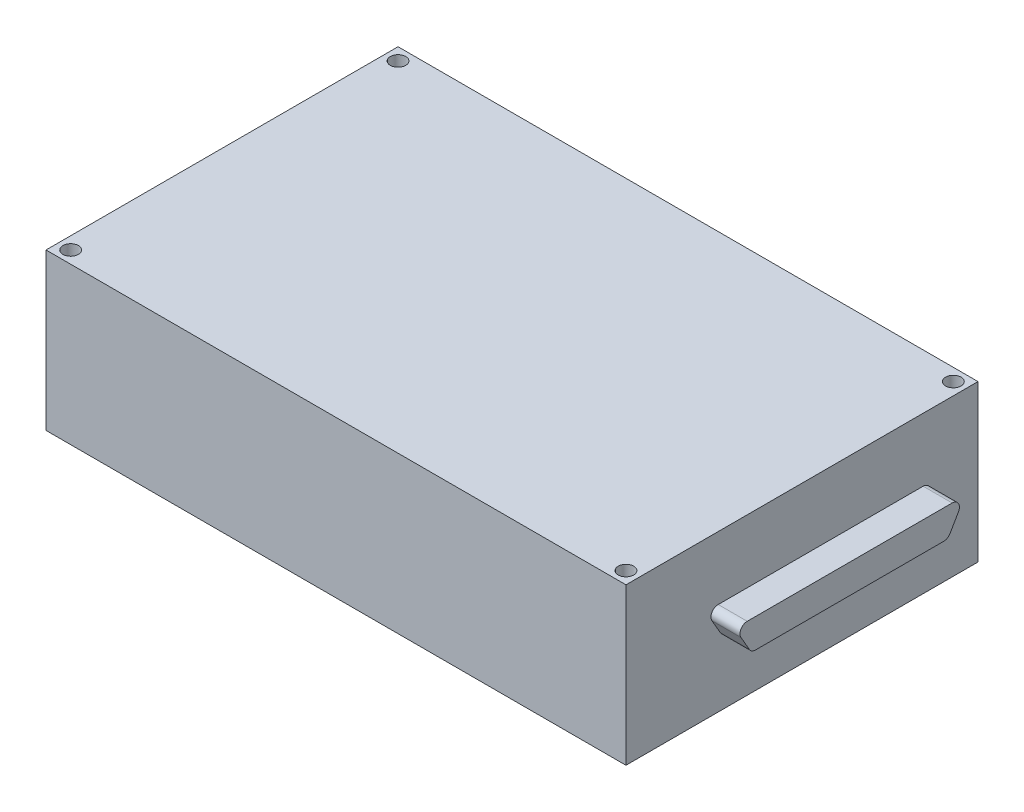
from build123d import *

# Parameters (mm, degrees)
SKETCH1_W                 = 101.6
SKETCH1_H                 = 61.6712
BOSS_EXTRUDE1_DEPTH       = 13.6906
BOSS_EXTRUDE2_DEPTH       = 5.08
SKETCH3_R                 = 5.08
BOSS_EXTRUDE3_DEPTH       = 5.08
SKETCH4_R                 = 1.905
BOSS_EXTRUDE4_DEPTH       = 3.81
F_6_32_TAPPED_HOLE1_D     = 2.7051
F_6_32_TAPPED_HOLE1_DEPTH = 6.35
F_6_32_TAPPED_HOLE1_TIP   = 0.81269403


with BuildPart() as part:
    # Sketch1 → Boss-Extrude1 (new, symmetric)
    with BuildSketch(Plane(origin=(0, 0, 0), x_dir=(1, 0, 0), z_dir=(0, 1, 0))):
        Rectangle(SKETCH1_W, SKETCH1_H)
    extrude(amount=BOSS_EXTRUDE1_DEPTH, both=True)

    # Sketch2 → Boss-Extrude2 (add)
    with BuildSketch(Plane(origin=(50.8, 0, 0), x_dir=(0, 0, -1), z_dir=(1, 0, 0))):
        with BuildLine():
            Line((-13.207078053, -2.4638), (19.760278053, -2.4638))
            ThreePointArc((19.760278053, -2.4638), (20.395278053, -2.293652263), (20.860130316, -1.8288))
            Line((20.860130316, -1.8288), (22.3266, 0.7112))
            ThreePointArc((22.3266, 0.7112), (22.3266, 1.9812), (21.226747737, 2.6162))
            Line((21.226747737, 2.6162), (-14.673547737, 2.6162))
            ThreePointArc((-14.673547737, 2.6162), (-15.7734, 1.9812), (-15.7734, 0.7112))
            Line((-15.7734, 0.7112), (-14.306930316, -1.8288))
            ThreePointArc((-14.306930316, -1.8288), (-13.842078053, -2.293652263), (-13.207078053, -2.4638))
        make_face()
    extrude(amount=BOSS_EXTRUDE2_DEPTH)

    # Sketch3 → Boss-Extrude3 (add)
    with BuildSketch(Plane.ZY.offset(50.8)):
        with Locations(Location((-12.0904, -1.9304, 0), (0, 0, 180))):
            Circle(SKETCH3_R)
    extrude(amount=BOSS_EXTRUDE3_DEPTH)

    # Sketch4 → Boss-Extrude4 (add)
    with BuildSketch(Plane.ZY.offset(50.8)):
        with Locations(Location((22.5298, 2.1336, 0), (0, 0, 180))):
            Circle(SKETCH4_R)
    extrude(amount=BOSS_EXTRUDE4_DEPTH)

    # 6-32 Tapped Hole1
    with Locations(Plane(origin=(0, 13.6906, 0), x_dir=(1, 0, 0), z_dir=(0, 1, 0))):
        with Locations((48.641, -28.6766), (-48.641, 28.6766), (48.641, 28.6766), (-48.641, -28.6766)):
            Hole(F_6_32_TAPPED_HOLE1_D / 2, depth=F_6_32_TAPPED_HOLE1_DEPTH)
            with Locations((0, 0, -(F_6_32_TAPPED_HOLE1_DEPTH + F_6_32_TAPPED_HOLE1_TIP / 2))):  # 118° drill point
                Cone(0, F_6_32_TAPPED_HOLE1_D / 2, F_6_32_TAPPED_HOLE1_TIP, mode=Mode.SUBTRACT)


solid = part.part
